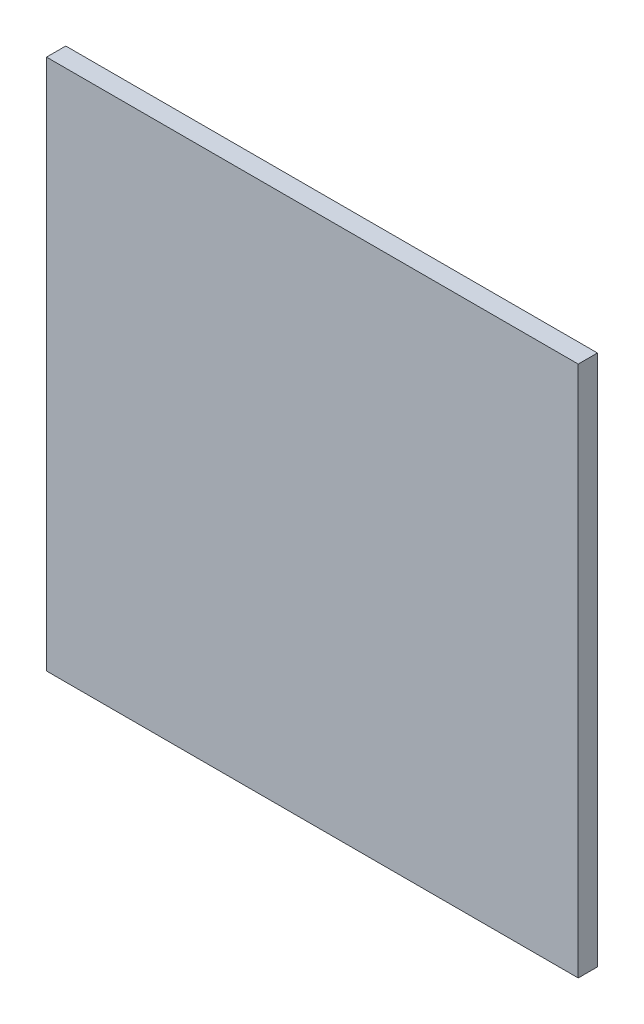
ISO-10303-21;
HEADER;
FILE_DESCRIPTION(('STEP AP214'),'2;1');
FILE_NAME('part.step','',(''),(''),'','','');
FILE_SCHEMA(('AUTOMOTIVE_DESIGN { 1 0 10303 214 1 1 1 1 }'));
ENDSEC;
DATA;
#1=APPLICATION_CONTEXT('core data for automotive mechanical design processes');
#2=APPLICATION_PROTOCOL_DEFINITION('international standard','automotive_design',2000,#1);
#3=PRODUCT_CONTEXT('',#1,'mechanical');
#4=PRODUCT('Part','Part','',(#3));
#5=PRODUCT_RELATED_PRODUCT_CATEGORY('part','',(#4));
#6=PRODUCT_DEFINITION_FORMATION('','',#4);
#7=PRODUCT_DEFINITION_CONTEXT('part definition',#1,'design');
#8=PRODUCT_DEFINITION('design','',#6,#7);
#9=PRODUCT_DEFINITION_SHAPE('','',#8);
#10=(LENGTH_UNIT() NAMED_UNIT(*) SI_UNIT(.MILLI.,.METRE.));
#11=(NAMED_UNIT(*) PLANE_ANGLE_UNIT() SI_UNIT($,.RADIAN.));
#12=(NAMED_UNIT(*) SI_UNIT($,.STERADIAN.) SOLID_ANGLE_UNIT());
#13=UNCERTAINTY_MEASURE_WITH_UNIT(LENGTH_MEASURE(1.E-05),#10,'distance_accuracy_value','');
#14=(GEOMETRIC_REPRESENTATION_CONTEXT(3) GLOBAL_UNCERTAINTY_ASSIGNED_CONTEXT((#13)) GLOBAL_UNIT_ASSIGNED_CONTEXT((#10,
#11,#12)) REPRESENTATION_CONTEXT('',''));
#15=CARTESIAN_POINT('',(0.,0.,0.));
#16=DIRECTION('',(0.,0.,1.));
#17=DIRECTION('',(1.,0.,0.));
#18=AXIS2_PLACEMENT_3D('',#15,#16,#17);
#19=CARTESIAN_POINT('',(207.5,207.5,15.));
#20=DIRECTION('',(-1.,0.,0.));
#21=DIRECTION('',(0.,-1.,0.));
#22=AXIS2_PLACEMENT_3D('',#19,#20,#21);
#23=PLANE('',#22);
#24=DIRECTION('',(0.,1.,0.));
#25=VECTOR('',#24,1.);
#26=CARTESIAN_POINT('',(207.5,207.5,0.));
#27=LINE('',#26,#25);
#28=CARTESIAN_POINT('',(207.5,-207.5,0.));
#29=VERTEX_POINT('',#28);
#30=CARTESIAN_POINT('',(207.5,207.5,0.));
#31=VERTEX_POINT('',#30);
#32=EDGE_CURVE('E111',#29,#31,#27,.T.);
#33=ORIENTED_EDGE('',*,*,#32,.T.);
#34=DIRECTION('',(0.,0.,-1.));
#35=VECTOR('',#34,1.);
#36=CARTESIAN_POINT('',(207.5,207.5,15.));
#37=LINE('',#36,#35);
#38=CARTESIAN_POINT('',(207.5,207.5,15.));
#39=VERTEX_POINT('',#38);
#40=EDGE_CURVE('E11',#39,#31,#37,.T.);
#41=ORIENTED_EDGE('',*,*,#40,.F.);
#42=DIRECTION('',(0.,1.,0.));
#43=VECTOR('',#42,1.);
#44=CARTESIAN_POINT('',(207.5,207.5,15.));
#45=LINE('',#44,#43);
#46=CARTESIAN_POINT('',(207.5,-207.5,15.));
#47=VERTEX_POINT('',#46);
#48=EDGE_CURVE('E95',#47,#39,#45,.T.);
#49=ORIENTED_EDGE('',*,*,#48,.F.);
#50=DIRECTION('',(0.,0.,-1.));
#51=VECTOR('',#50,1.);
#52=CARTESIAN_POINT('',(207.5,-207.5,15.));
#53=LINE('',#52,#51);
#54=EDGE_CURVE('E107',#47,#29,#53,.T.);
#55=ORIENTED_EDGE('',*,*,#54,.T.);
#56=EDGE_LOOP('',(#33,#41,#49,#55));
#57=FACE_BOUND('',#56,.T.);
#58=ADVANCED_FACE('F43',(#57),#23,.F.);
#59=CARTESIAN_POINT('',(-207.5,207.5,15.));
#60=DIRECTION('',(0.,-1.,0.));
#61=DIRECTION('',(0.,0.,-1.));
#62=AXIS2_PLACEMENT_3D('',#59,#60,#61);
#63=PLANE('',#62);
#64=DIRECTION('',(-1.,0.,0.));
#65=VECTOR('',#64,1.);
#66=CARTESIAN_POINT('',(-207.5,207.5,0.));
#67=LINE('',#66,#65);
#68=CARTESIAN_POINT('',(-207.5,207.5,0.));
#69=VERTEX_POINT('',#68);
#70=EDGE_CURVE('E100',#31,#69,#67,.T.);
#71=ORIENTED_EDGE('',*,*,#70,.T.);
#72=DIRECTION('',(0.,0.,-1.));
#73=VECTOR('',#72,1.);
#74=CARTESIAN_POINT('',(-207.5,207.5,15.));
#75=LINE('',#74,#73);
#76=CARTESIAN_POINT('',(-207.5,207.5,15.));
#77=VERTEX_POINT('',#76);
#78=EDGE_CURVE('E52',#77,#69,#75,.T.);
#79=ORIENTED_EDGE('',*,*,#78,.F.);
#80=DIRECTION('',(-1.,0.,0.));
#81=VECTOR('',#80,1.);
#82=CARTESIAN_POINT('',(-207.5,207.5,15.));
#83=LINE('',#82,#81);
#84=EDGE_CURVE('E90',#39,#77,#83,.T.);
#85=ORIENTED_EDGE('',*,*,#84,.F.);
#86=ORIENTED_EDGE('',*,*,#40,.T.);
#87=EDGE_LOOP('',(#71,#79,#85,#86));
#88=FACE_BOUND('',#87,.T.);
#89=ADVANCED_FACE('F99',(#88),#63,.F.);
#90=CARTESIAN_POINT('',(-207.5,207.5,15.));
#91=DIRECTION('',(1.,0.,0.));
#92=DIRECTION('',(0.,1.,0.));
#93=AXIS2_PLACEMENT_3D('',#90,#91,#92);
#94=PLANE('',#93);
#95=DIRECTION('',(0.,-1.,0.));
#96=VECTOR('',#95,1.);
#97=CARTESIAN_POINT('',(-207.5,207.5,0.));
#98=LINE('',#97,#96);
#99=CARTESIAN_POINT('',(-207.5,-207.5,0.));
#100=VERTEX_POINT('',#99);
#101=EDGE_CURVE('E77',#69,#100,#98,.T.);
#102=ORIENTED_EDGE('',*,*,#101,.T.);
#103=DIRECTION('',(0.,0.,-1.));
#104=VECTOR('',#103,1.);
#105=CARTESIAN_POINT('',(-207.5,-207.5,15.));
#106=LINE('',#105,#104);
#107=CARTESIAN_POINT('',(-207.5,-207.5,15.));
#108=VERTEX_POINT('',#107);
#109=EDGE_CURVE('E102',#108,#100,#106,.T.);
#110=ORIENTED_EDGE('',*,*,#109,.F.);
#111=DIRECTION('',(0.,-1.,0.));
#112=VECTOR('',#111,1.);
#113=CARTESIAN_POINT('',(-207.5,207.5,15.));
#114=LINE('',#113,#112);
#115=EDGE_CURVE('E93',#77,#108,#114,.T.);
#116=ORIENTED_EDGE('',*,*,#115,.F.);
#117=ORIENTED_EDGE('',*,*,#78,.T.);
#118=EDGE_LOOP('',(#102,#110,#116,#117));
#119=FACE_BOUND('',#118,.T.);
#120=ADVANCED_FACE('F103',(#119),#94,.F.);
#121=CARTESIAN_POINT('',(-207.5,-207.5,15.));
#122=DIRECTION('',(0.,1.,0.));
#123=DIRECTION('',(0.,0.,1.));
#124=AXIS2_PLACEMENT_3D('',#121,#122,#123);
#125=PLANE('',#124);
#126=DIRECTION('',(1.,0.,0.));
#127=VECTOR('',#126,1.);
#128=CARTESIAN_POINT('',(-207.5,-207.5,0.));
#129=LINE('',#128,#127);
#130=EDGE_CURVE('E83',#100,#29,#129,.T.);
#131=ORIENTED_EDGE('',*,*,#130,.T.);
#132=ORIENTED_EDGE('',*,*,#54,.F.);
#133=DIRECTION('',(1.,0.,0.));
#134=VECTOR('',#133,1.);
#135=CARTESIAN_POINT('',(-207.5,-207.5,15.));
#136=LINE('',#135,#134);
#137=EDGE_CURVE('E60',#108,#47,#136,.T.);
#138=ORIENTED_EDGE('',*,*,#137,.F.);
#139=ORIENTED_EDGE('',*,*,#109,.T.);
#140=EDGE_LOOP('',(#131,#132,#138,#139));
#141=FACE_BOUND('',#140,.T.);
#142=ADVANCED_FACE('F124',(#141),#125,.F.);
#143=CARTESIAN_POINT('',(0.,0.,15.));
#144=DIRECTION('',(0.,0.,1.));
#145=DIRECTION('',(1.,0.,0.));
#146=AXIS2_PLACEMENT_3D('',#143,#144,#145);
#147=PLANE('',#146);
#148=ORIENTED_EDGE('',*,*,#48,.T.);
#149=ORIENTED_EDGE('',*,*,#84,.T.);
#150=ORIENTED_EDGE('',*,*,#115,.T.);
#151=ORIENTED_EDGE('',*,*,#137,.T.);
#152=EDGE_LOOP('',(#148,#149,#150,#151));
#153=FACE_BOUND('',#152,.T.);
#154=ADVANCED_FACE('F91',(#153),#147,.T.);
#155=CARTESIAN_POINT('',(0.,0.,0.));
#156=DIRECTION('',(0.,0.,1.));
#157=DIRECTION('',(1.,0.,0.));
#158=AXIS2_PLACEMENT_3D('',#155,#156,#157);
#159=PLANE('',#158);
#160=ORIENTED_EDGE('',*,*,#32,.F.);
#161=ORIENTED_EDGE('',*,*,#130,.F.);
#162=ORIENTED_EDGE('',*,*,#101,.F.);
#163=ORIENTED_EDGE('',*,*,#70,.F.);
#164=EDGE_LOOP('',(#160,#161,#162,#163));
#165=FACE_BOUND('',#164,.T.);
#166=ADVANCED_FACE('F127',(#165),#159,.F.);
#167=CLOSED_SHELL('',(#58,#89,#120,#142,#154,#166));
#168=MANIFOLD_SOLID_BREP('B2',#167);
#169=ADVANCED_BREP_SHAPE_REPRESENTATION('',(#18,#168),#14);
#170=SHAPE_DEFINITION_REPRESENTATION(#9,#169);
ENDSEC;
END-ISO-10303-21;
